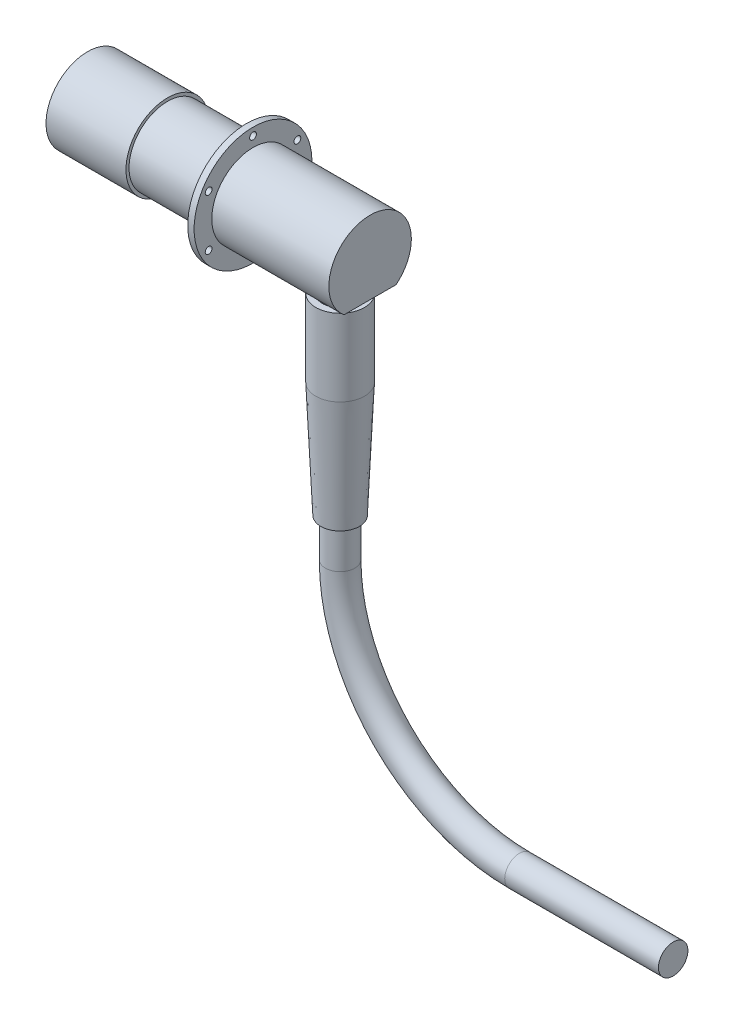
ISO-10303-21;
HEADER;
FILE_DESCRIPTION(('STEP AP214'),'2;1');
FILE_NAME('part.step','',(''),(''),'','','');
FILE_SCHEMA(('AUTOMOTIVE_DESIGN { 1 0 10303 214 1 1 1 1 }'));
ENDSEC;
DATA;
#1=APPLICATION_CONTEXT('core data for automotive mechanical design processes');
#2=APPLICATION_PROTOCOL_DEFINITION('international standard','automotive_design',2000,#1);
#3=PRODUCT_CONTEXT('',#1,'mechanical');
#4=PRODUCT('Part','Part','',(#3));
#5=PRODUCT_RELATED_PRODUCT_CATEGORY('part','',(#4));
#6=PRODUCT_DEFINITION_FORMATION('','',#4);
#7=PRODUCT_DEFINITION_CONTEXT('part definition',#1,'design');
#8=PRODUCT_DEFINITION('design','',#6,#7);
#9=PRODUCT_DEFINITION_SHAPE('','',#8);
#10=(LENGTH_UNIT() NAMED_UNIT(*) SI_UNIT(.MILLI.,.METRE.));
#11=(NAMED_UNIT(*) PLANE_ANGLE_UNIT() SI_UNIT($,.RADIAN.));
#12=(NAMED_UNIT(*) SI_UNIT($,.STERADIAN.) SOLID_ANGLE_UNIT());
#13=UNCERTAINTY_MEASURE_WITH_UNIT(LENGTH_MEASURE(1.E-05),#10,'distance_accuracy_value','');
#14=(GEOMETRIC_REPRESENTATION_CONTEXT(3) GLOBAL_UNCERTAINTY_ASSIGNED_CONTEXT((#13)) GLOBAL_UNIT_ASSIGNED_CONTEXT((#10,
#11,#12)) REPRESENTATION_CONTEXT('',''));
#15=CARTESIAN_POINT('',(0.,0.,0.));
#16=DIRECTION('',(0.,0.,1.));
#17=DIRECTION('',(1.,0.,0.));
#18=AXIS2_PLACEMENT_3D('',#15,#16,#17);
#19=CARTESIAN_POINT('',(0.,0.,0.));
#20=DIRECTION('',(1.,0.,0.));
#21=DIRECTION('',(0.,0.,-1.));
#22=AXIS2_PLACEMENT_3D('',#19,#20,#21);
#23=PLANE('',#22);
#24=CARTESIAN_POINT('',(0.,0.,0.));
#25=DIRECTION('',(-1.,0.,0.));
#26=DIRECTION('',(0.,0.,1.));
#27=AXIS2_PLACEMENT_3D('',#24,#25,#26);
#28=CIRCLE('',#27,32.7904477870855);
#29=CARTESIAN_POINT('',(0.,0.,32.7904477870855));
#30=VERTEX_POINT('',#29);
#31=EDGE_CURVE('E421',#30,#30,#28,.T.);
#32=ORIENTED_EDGE('',*,*,#31,.F.);
#33=EDGE_LOOP('',(#32));
#34=FACE_BOUND('',#33,.T.);
#35=CARTESIAN_POINT('',(0.,0.,0.));
#36=DIRECTION('',(1.,0.,0.));
#37=DIRECTION('',(0.,0.,-1.));
#38=AXIS2_PLACEMENT_3D('',#35,#36,#37);
#39=CIRCLE('',#38,41.148);
#40=CARTESIAN_POINT('',(0.,0.,-41.148));
#41=VERTEX_POINT('',#40);
#42=EDGE_CURVE('E449',#41,#41,#39,.T.);
#43=ORIENTED_EDGE('',*,*,#42,.F.);
#44=EDGE_LOOP('',(#43));
#45=FACE_BOUND('',#44,.T.);
#46=ADVANCED_FACE('F380',(#34,#45),#23,.F.);
#47=CARTESIAN_POINT('',(0.,0.,0.));
#48=DIRECTION('',(1.,0.,0.));
#49=DIRECTION('',(0.,0.,-1.));
#50=AXIS2_PLACEMENT_3D('',#47,#48,#49);
#51=CYLINDRICAL_SURFACE('',#50,41.148);
#52=CARTESIAN_POINT('',(79.248,0.,1.11022302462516E-13));
#53=DIRECTION('',(1.,0.,0.));
#54=DIRECTION('',(0.,0.,-1.));
#55=AXIS2_PLACEMENT_3D('',#52,#53,#54);
#56=CIRCLE('',#55,41.148);
#57=CARTESIAN_POINT('',(79.248,0.,-41.1479999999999));
#58=VERTEX_POINT('',#57);
#59=EDGE_CURVE('E446',#58,#58,#56,.T.);
#60=ORIENTED_EDGE('',*,*,#59,.F.);
#61=EDGE_LOOP('',(#60));
#62=FACE_BOUND('',#61,.T.);
#63=ORIENTED_EDGE('',*,*,#42,.T.);
#64=EDGE_LOOP('',(#63));
#65=FACE_BOUND('',#64,.T.);
#66=ADVANCED_FACE('F466',(#62,#65),#51,.T.);
#67=CARTESIAN_POINT('',(79.248,-41.148,1.11022302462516E-13));
#68=DIRECTION('',(-1.,0.,0.));
#69=DIRECTION('',(0.,0.,1.));
#70=AXIS2_PLACEMENT_3D('',#67,#68,#69);
#71=PLANE('',#70);
#72=CARTESIAN_POINT('',(79.248,0.,1.11022302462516E-13));
#73=DIRECTION('',(1.,0.,0.));
#74=DIRECTION('',(0.,0.,-1.));
#75=AXIS2_PLACEMENT_3D('',#72,#73,#74);
#76=CIRCLE('',#75,38.1);
#77=CARTESIAN_POINT('',(79.248,0.,-38.0999999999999));
#78=VERTEX_POINT('',#77);
#79=EDGE_CURVE('E443',#78,#78,#76,.T.);
#80=ORIENTED_EDGE('',*,*,#79,.F.);
#81=EDGE_LOOP('',(#80));
#82=FACE_BOUND('',#81,.T.);
#83=ORIENTED_EDGE('',*,*,#59,.T.);
#84=EDGE_LOOP('',(#83));
#85=FACE_BOUND('',#84,.T.);
#86=ADVANCED_FACE('F471',(#82,#85),#71,.F.);
#87=CARTESIAN_POINT('',(0.,0.,0.));
#88=DIRECTION('',(1.,0.,0.));
#89=DIRECTION('',(0.,0.,-1.));
#90=AXIS2_PLACEMENT_3D('',#87,#88,#89);
#91=CYLINDRICAL_SURFACE('',#90,38.1);
#92=CARTESIAN_POINT('',(157.734,2.22044604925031E-13,0.));
#93=DIRECTION('',(1.,0.,0.));
#94=DIRECTION('',(0.,0.,-1.));
#95=AXIS2_PLACEMENT_3D('',#92,#93,#94);
#96=CIRCLE('',#95,38.1);
#97=CARTESIAN_POINT('',(157.734,2.22044604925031E-13,-38.1));
#98=VERTEX_POINT('',#97);
#99=EDGE_CURVE('E440',#98,#98,#96,.T.);
#100=ORIENTED_EDGE('',*,*,#99,.F.);
#101=EDGE_LOOP('',(#100));
#102=FACE_BOUND('',#101,.T.);
#103=ORIENTED_EDGE('',*,*,#79,.T.);
#104=EDGE_LOOP('',(#103));
#105=FACE_BOUND('',#104,.T.);
#106=ADVANCED_FACE('F481',(#102,#105),#91,.T.);
#107=CARTESIAN_POINT('',(157.734,-38.1,0.));
#108=DIRECTION('',(1.,0.,0.));
#109=DIRECTION('',(0.,0.,-1.));
#110=AXIS2_PLACEMENT_3D('',#107,#108,#109);
#111=PLANE('',#110);
#112=CARTESIAN_POINT('',(157.734,25.4000000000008,43.9940905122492));
#113=DIRECTION('',(-1.,0.,0.));
#114=DIRECTION('',(0.,-0.866025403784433,0.50000000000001));
#115=AXIS2_PLACEMENT_3D('',#112,#113,#114);
#116=CIRCLE('',#115,3.3782);
#117=CARTESIAN_POINT('',(157.734,22.4743929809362,45.6831905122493));
#118=VERTEX_POINT('',#117);
#119=EDGE_CURVE('E728',#118,#118,#116,.T.);
#120=ORIENTED_EDGE('',*,*,#119,.F.);
#121=EDGE_LOOP('',(#120));
#122=FACE_BOUND('',#121,.T.);
#123=CARTESIAN_POINT('',(157.734,-25.3999999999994,43.9940905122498));
#124=DIRECTION('',(-1.,0.,0.));
#125=DIRECTION('',(0.,-0.866025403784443,-0.499999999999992));
#126=AXIS2_PLACEMENT_3D('',#123,#124,#125);
#127=CIRCLE('',#126,3.3782);
#128=CARTESIAN_POINT('',(157.734,-28.325607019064,42.3049905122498));
#129=VERTEX_POINT('',#128);
#130=EDGE_CURVE('E739',#129,#129,#127,.T.);
#131=ORIENTED_EDGE('',*,*,#130,.F.);
#132=EDGE_LOOP('',(#131));
#133=FACE_BOUND('',#132,.T.);
#134=CARTESIAN_POINT('',(157.734,-50.8,3.60822483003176E-13));
#135=DIRECTION('',(-1.,0.,0.));
#136=DIRECTION('',(0.,0.,-1.));
#137=AXIS2_PLACEMENT_3D('',#134,#135,#136);
#138=CIRCLE('',#137,3.3782);
#139=CARTESIAN_POINT('',(157.734,-50.8,-3.37819999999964));
#140=VERTEX_POINT('',#139);
#141=EDGE_CURVE('E743',#140,#140,#138,.T.);
#142=ORIENTED_EDGE('',*,*,#141,.F.);
#143=EDGE_LOOP('',(#142));
#144=FACE_BOUND('',#143,.T.);
#145=CARTESIAN_POINT('',(157.734,-25.4,-43.9940905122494));
#146=DIRECTION('',(-1.,0.,0.));
#147=DIRECTION('',(0.,0.866025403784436,-0.500000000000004));
#148=AXIS2_PLACEMENT_3D('',#145,#146,#147);
#149=CIRCLE('',#148,3.3782);
#150=CARTESIAN_POINT('',(157.734,-22.4743929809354,-45.6831905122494));
#151=VERTEX_POINT('',#150);
#152=EDGE_CURVE('E745',#151,#151,#149,.T.);
#153=ORIENTED_EDGE('',*,*,#152,.F.);
#154=EDGE_LOOP('',(#153));
#155=FACE_BOUND('',#154,.T.);
#156=CARTESIAN_POINT('',(157.734,25.4000000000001,-43.9940905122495));
#157=DIRECTION('',(-1.,0.,0.));
#158=DIRECTION('',(0.,0.86602540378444,0.499999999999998));
#159=AXIS2_PLACEMENT_3D('',#156,#157,#158);
#160=CIRCLE('',#159,3.3782);
#161=CARTESIAN_POINT('',(157.734,28.3256070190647,-42.3049905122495));
#162=VERTEX_POINT('',#161);
#163=EDGE_CURVE('E751',#162,#162,#160,.T.);
#164=ORIENTED_EDGE('',*,*,#163,.F.);
#165=EDGE_LOOP('',(#164));
#166=FACE_BOUND('',#165,.T.);
#167=CARTESIAN_POINT('',(157.734,50.8000000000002,0.));
#168=DIRECTION('',(-1.,0.,0.));
#169=DIRECTION('',(0.,0.,1.));
#170=AXIS2_PLACEMENT_3D('',#167,#168,#169);
#171=CIRCLE('',#170,3.3782);
#172=CARTESIAN_POINT('',(157.734,50.8000000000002,3.3782));
#173=VERTEX_POINT('',#172);
#174=EDGE_CURVE('E538',#173,#173,#171,.T.);
#175=ORIENTED_EDGE('',*,*,#174,.F.);
#176=EDGE_LOOP('',(#175));
#177=FACE_BOUND('',#176,.T.);
#178=CARTESIAN_POINT('',(157.734,2.22044604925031E-13,0.));
#179=DIRECTION('',(1.,0.,0.));
#180=DIRECTION('',(0.,0.,-1.));
#181=AXIS2_PLACEMENT_3D('',#178,#179,#180);
#182=CIRCLE('',#181,58.42);
#183=CARTESIAN_POINT('',(157.734,2.22044604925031E-13,-58.42));
#184=VERTEX_POINT('',#183);
#185=EDGE_CURVE('E437',#184,#184,#182,.T.);
#186=ORIENTED_EDGE('',*,*,#185,.F.);
#187=EDGE_LOOP('',(#186));
#188=FACE_BOUND('',#187,.T.);
#189=ORIENTED_EDGE('',*,*,#99,.T.);
#190=EDGE_LOOP('',(#189));
#191=FACE_BOUND('',#190,.T.);
#192=ADVANCED_FACE('F488',(#122,#133,#144,#155,#166,#177,#188,#191),#111,.F.);
#193=CARTESIAN_POINT('',(0.,0.,0.));
#194=DIRECTION('',(1.,0.,0.));
#195=DIRECTION('',(0.,0.,-1.));
#196=AXIS2_PLACEMENT_3D('',#193,#194,#195);
#197=CYLINDRICAL_SURFACE('',#196,58.42);
#198=CARTESIAN_POINT('',(164.084,2.22044604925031E-13,0.));
#199=DIRECTION('',(1.,0.,0.));
#200=DIRECTION('',(0.,0.,-1.));
#201=AXIS2_PLACEMENT_3D('',#198,#199,#200);
#202=CIRCLE('',#201,58.42);
#203=CARTESIAN_POINT('',(164.084,2.22044604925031E-13,-58.42));
#204=VERTEX_POINT('',#203);
#205=EDGE_CURVE('E434',#204,#204,#202,.T.);
#206=ORIENTED_EDGE('',*,*,#205,.F.);
#207=EDGE_LOOP('',(#206));
#208=FACE_BOUND('',#207,.T.);
#209=ORIENTED_EDGE('',*,*,#185,.T.);
#210=EDGE_LOOP('',(#209));
#211=FACE_BOUND('',#210,.T.);
#212=ADVANCED_FACE('F492',(#208,#211),#197,.T.);
#213=CARTESIAN_POINT('',(164.084,-58.42,0.));
#214=DIRECTION('',(-1.,0.,0.));
#215=DIRECTION('',(0.,0.,1.));
#216=AXIS2_PLACEMENT_3D('',#213,#214,#215);
#217=PLANE('',#216);
#218=CARTESIAN_POINT('',(164.084,25.4000000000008,43.9940905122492));
#219=DIRECTION('',(-1.,0.,0.));
#220=DIRECTION('',(0.,0.,1.));
#221=AXIS2_PLACEMENT_3D('',#218,#219,#220);
#222=CIRCLE('',#221,3.3782);
#223=CARTESIAN_POINT('',(164.084,25.4000000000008,47.3722905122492));
#224=VERTEX_POINT('',#223);
#225=EDGE_CURVE('E504',#224,#224,#222,.F.);
#226=ORIENTED_EDGE('',*,*,#225,.F.);
#227=EDGE_LOOP('',(#226));
#228=FACE_BOUND('',#227,.T.);
#229=CARTESIAN_POINT('',(164.084,-25.3999999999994,43.9940905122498));
#230=DIRECTION('',(-1.,0.,0.));
#231=DIRECTION('',(0.,0.,1.));
#232=AXIS2_PLACEMENT_3D('',#229,#230,#231);
#233=CIRCLE('',#232,3.3782);
#234=CARTESIAN_POINT('',(164.084,-25.3999999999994,47.3722905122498));
#235=VERTEX_POINT('',#234);
#236=EDGE_CURVE('E508',#235,#235,#233,.F.);
#237=ORIENTED_EDGE('',*,*,#236,.F.);
#238=EDGE_LOOP('',(#237));
#239=FACE_BOUND('',#238,.T.);
#240=CARTESIAN_POINT('',(164.084,-50.8,3.60822483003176E-13));
#241=DIRECTION('',(-1.,0.,0.));
#242=DIRECTION('',(0.,0.,1.));
#243=AXIS2_PLACEMENT_3D('',#240,#241,#242);
#244=CIRCLE('',#243,3.3782);
#245=CARTESIAN_POINT('',(164.084,-50.8,3.37820000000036));
#246=VERTEX_POINT('',#245);
#247=EDGE_CURVE('E512',#246,#246,#244,.F.);
#248=ORIENTED_EDGE('',*,*,#247,.F.);
#249=EDGE_LOOP('',(#248));
#250=FACE_BOUND('',#249,.T.);
#251=CARTESIAN_POINT('',(164.084,-25.4,-43.9940905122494));
#252=DIRECTION('',(-1.,0.,0.));
#253=DIRECTION('',(0.,0.,1.));
#254=AXIS2_PLACEMENT_3D('',#251,#252,#253);
#255=CIRCLE('',#254,3.3782);
#256=CARTESIAN_POINT('',(164.084,-25.4,-40.6158905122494));
#257=VERTEX_POINT('',#256);
#258=EDGE_CURVE('E516',#257,#257,#255,.F.);
#259=ORIENTED_EDGE('',*,*,#258,.F.);
#260=EDGE_LOOP('',(#259));
#261=FACE_BOUND('',#260,.T.);
#262=CARTESIAN_POINT('',(164.084,25.4000000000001,-43.9940905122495));
#263=DIRECTION('',(-1.,0.,0.));
#264=DIRECTION('',(0.,0.,1.));
#265=AXIS2_PLACEMENT_3D('',#262,#263,#264);
#266=CIRCLE('',#265,3.3782);
#267=CARTESIAN_POINT('',(164.084,25.4000000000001,-40.6158905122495));
#268=VERTEX_POINT('',#267);
#269=EDGE_CURVE('E520',#268,#268,#266,.F.);
#270=ORIENTED_EDGE('',*,*,#269,.F.);
#271=EDGE_LOOP('',(#270));
#272=FACE_BOUND('',#271,.T.);
#273=CARTESIAN_POINT('',(164.084,50.8000000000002,0.));
#274=DIRECTION('',(-1.,0.,0.));
#275=DIRECTION('',(0.,0.,1.));
#276=AXIS2_PLACEMENT_3D('',#273,#274,#275);
#277=CIRCLE('',#276,3.3782);
#278=CARTESIAN_POINT('',(164.084,50.8000000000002,3.3782));
#279=VERTEX_POINT('',#278);
#280=EDGE_CURVE('E524',#279,#279,#277,.F.);
#281=ORIENTED_EDGE('',*,*,#280,.F.);
#282=EDGE_LOOP('',(#281));
#283=FACE_BOUND('',#282,.T.);
#284=CARTESIAN_POINT('',(164.084,2.22044604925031E-13,0.));
#285=DIRECTION('',(1.,0.,0.));
#286=DIRECTION('',(0.,0.,-1.));
#287=AXIS2_PLACEMENT_3D('',#284,#285,#286);
#288=CIRCLE('',#287,40.894);
#289=CARTESIAN_POINT('',(164.084,2.22044604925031E-13,-40.894));
#290=VERTEX_POINT('',#289);
#291=EDGE_CURVE('E431',#290,#290,#288,.T.);
#292=ORIENTED_EDGE('',*,*,#291,.F.);
#293=EDGE_LOOP('',(#292));
#294=FACE_BOUND('',#293,.T.);
#295=ORIENTED_EDGE('',*,*,#205,.T.);
#296=EDGE_LOOP('',(#295));
#297=FACE_BOUND('',#296,.T.);
#298=ADVANCED_FACE('F463',(#228,#239,#250,#261,#272,#283,#294,#297),#217,.F.);
#299=CARTESIAN_POINT('',(0.,0.,0.));
#300=DIRECTION('',(1.,0.,0.));
#301=DIRECTION('',(0.,0.,-1.));
#302=AXIS2_PLACEMENT_3D('',#299,#300,#301);
#303=CYLINDRICAL_SURFACE('',#302,40.894);
#304=CARTESIAN_POINT('',(264.587074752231,0.,0.));
#305=DIRECTION('',(-0.707106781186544,0.707106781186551,0.));
#306=DIRECTION('',(0.707106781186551,0.707106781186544,0.));
#307=AXIS2_PLACEMENT_3D('',#304,#305,#306);
#308=ELLIPSE('',#307,57.8328494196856,40.894);
#309=CARTESIAN_POINT('',(232.83707475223,-31.7499999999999,-25.7731786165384));
#310=VERTEX_POINT('',#309);
#311=CARTESIAN_POINT('',(232.83707475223,-31.7499999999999,25.7731786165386));
#312=VERTEX_POINT('',#311);
#313=EDGE_CURVE('E383',#310,#312,#308,.T.);
#314=ORIENTED_EDGE('',*,*,#313,.T.);
#315=DIRECTION('',(1.,0.,0.));
#316=VECTOR('',#315,1.);
#317=CARTESIAN_POINT('',(0.,-31.7499999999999,25.7731786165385));
#318=LINE('',#317,#316);
#319=CARTESIAN_POINT('',(280.162,-31.7499999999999,25.7731786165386));
#320=VERTEX_POINT('',#319);
#321=EDGE_CURVE('E412',#312,#320,#318,.T.);
#322=ORIENTED_EDGE('',*,*,#321,.T.);
#323=CARTESIAN_POINT('',(280.162,0.,0.));
#324=DIRECTION('',(1.,0.,0.));
#325=DIRECTION('',(0.,0.,-1.));
#326=AXIS2_PLACEMENT_3D('',#323,#324,#325);
#327=CIRCLE('',#326,40.894);
#328=CARTESIAN_POINT('',(280.162,-31.7499999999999,-25.7731786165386));
#329=VERTEX_POINT('',#328);
#330=EDGE_CURVE('E419',#329,#320,#327,.T.);
#331=ORIENTED_EDGE('',*,*,#330,.F.);
#332=DIRECTION('',(1.,0.,0.));
#333=VECTOR('',#332,1.);
#334=CARTESIAN_POINT('',(0.,-31.7499999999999,-25.7731786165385));
#335=LINE('',#334,#333);
#336=EDGE_CURVE('E395',#329,#310,#335,.F.);
#337=ORIENTED_EDGE('',*,*,#336,.T.);
#338=EDGE_LOOP('',(#314,#322,#331,#337));
#339=FACE_BOUND('',#338,.T.);
#340=ORIENTED_EDGE('',*,*,#291,.T.);
#341=EDGE_LOOP('',(#340));
#342=FACE_BOUND('',#341,.T.);
#343=ADVANCED_FACE('F416',(#339,#342),#303,.T.);
#344=CARTESIAN_POINT('',(280.162,-40.894,0.));
#345=DIRECTION('',(-1.,0.,0.));
#346=DIRECTION('',(0.,0.,1.));
#347=AXIS2_PLACEMENT_3D('',#344,#345,#346);
#348=PLANE('',#347);
#349=ORIENTED_EDGE('',*,*,#330,.T.);
#350=DIRECTION('',(0.,0.,-1.));
#351=VECTOR('',#350,1.);
#352=CARTESIAN_POINT('',(280.162,-31.7499999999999,0.));
#353=LINE('',#352,#351);
#354=EDGE_CURVE('E399',#320,#329,#353,.T.);
#355=ORIENTED_EDGE('',*,*,#354,.T.);
#356=EDGE_LOOP('',(#349,#355));
#357=FACE_BOUND('',#356,.T.);
#358=ADVANCED_FACE('F452',(#357),#348,.F.);
#359=CARTESIAN_POINT('',(69.85,0.,1.11022302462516E-13));
#360=DIRECTION('',(-1.,0.,0.));
#361=DIRECTION('',(0.,0.,1.));
#362=AXIS2_PLACEMENT_3D('',#359,#360,#361);
#363=CYLINDRICAL_SURFACE('',#362,32.7904477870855);
#364=CARTESIAN_POINT('',(69.85,0.,1.11022302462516E-13));
#365=DIRECTION('',(-1.,0.,0.));
#366=DIRECTION('',(0.,0.,1.));
#367=AXIS2_PLACEMENT_3D('',#364,#365,#366);
#368=CIRCLE('',#367,32.7904477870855);
#369=CARTESIAN_POINT('',(69.85,0.,32.7904477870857));
#370=VERTEX_POINT('',#369);
#371=EDGE_CURVE('E427',#370,#370,#368,.T.);
#372=ORIENTED_EDGE('',*,*,#371,.F.);
#373=EDGE_LOOP('',(#372));
#374=FACE_BOUND('',#373,.T.);
#375=ORIENTED_EDGE('',*,*,#31,.T.);
#376=EDGE_LOOP('',(#375));
#377=FACE_BOUND('',#376,.T.);
#378=ADVANCED_FACE('F454',(#374,#377),#363,.F.);
#379=CARTESIAN_POINT('',(69.85,0.,1.11022302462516E-13));
#380=DIRECTION('',(-1.,0.,0.));
#381=DIRECTION('',(0.,0.,1.));
#382=AXIS2_PLACEMENT_3D('',#379,#380,#381);
#383=PLANE('',#382);
#384=ORIENTED_EDGE('',*,*,#371,.T.);
#385=EDGE_LOOP('',(#384));
#386=FACE_BOUND('',#385,.T.);
#387=ADVANCED_FACE('F460',(#386),#383,.T.);
#388=CARTESIAN_POINT('',(232.83707475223,-31.7499999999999,-38.0999999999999));
#389=DIRECTION('',(-0.707106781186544,0.707106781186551,0.));
#390=DIRECTION('',(-0.707106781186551,-0.707106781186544,0.));
#391=AXIS2_PLACEMENT_3D('',#388,#389,#390);
#392=PLANE('',#391);
#393=DIRECTION('',(0.,0.,1.));
#394=VECTOR('',#393,1.);
#395=CARTESIAN_POINT('',(232.83707475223,-31.7499999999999,-38.0999999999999));
#396=LINE('',#395,#394);
#397=EDGE_CURVE('E409',#310,#312,#396,.T.);
#398=ORIENTED_EDGE('',*,*,#397,.T.);
#399=ORIENTED_EDGE('',*,*,#313,.F.);
#400=EDGE_LOOP('',(#398,#399));
#401=FACE_BOUND('',#400,.T.);
#402=ADVANCED_FACE('F408',(#401),#392,.F.);
#403=CARTESIAN_POINT('',(288.741448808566,-31.7499999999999,-38.1));
#404=DIRECTION('',(0.,1.,0.));
#405=DIRECTION('',(-1.,0.,0.));
#406=AXIS2_PLACEMENT_3D('',#403,#404,#405);
#407=PLANE('',#406);
#408=CARTESIAN_POINT('',(250.444,-31.7499999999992,1.11022302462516E-13));
#409=DIRECTION('',(0.,-1.,0.));
#410=DIRECTION('',(0.,0.,-1.));
#411=AXIS2_PLACEMENT_3D('',#408,#409,#410);
#412=CIRCLE('',#411,16.5100000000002);
#413=CARTESIAN_POINT('',(250.444,-31.7499999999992,-16.5100000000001));
#414=VERTEX_POINT('',#413);
#415=EDGE_CURVE('E537',#414,#414,#412,.T.);
#416=ORIENTED_EDGE('',*,*,#415,.F.);
#417=EDGE_LOOP('',(#416));
#418=FACE_BOUND('',#417,.T.);
#419=ORIENTED_EDGE('',*,*,#397,.F.);
#420=ORIENTED_EDGE('',*,*,#336,.F.);
#421=ORIENTED_EDGE('',*,*,#354,.F.);
#422=ORIENTED_EDGE('',*,*,#321,.F.);
#423=EDGE_LOOP('',(#419,#420,#421,#422));
#424=FACE_BOUND('',#423,.T.);
#425=ADVANCED_FACE('F411',(#418,#424),#407,.F.);
#426=CARTESIAN_POINT('',(250.444,-231.720645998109,1.11022302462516E-13));
#427=DIRECTION('',(0.,-1.,0.));
#428=DIRECTION('',(0.,0.,-1.));
#429=AXIS2_PLACEMENT_3D('',#426,#427,#428);
#430=PLANE('',#429);
#431=CARTESIAN_POINT('',(250.444,-231.720645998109,1.11022302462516E-13));
#432=DIRECTION('',(0.,-1.,0.));
#433=DIRECTION('',(0.,0.,-1.));
#434=AXIS2_PLACEMENT_3D('',#431,#432,#433);
#435=CIRCLE('',#434,14.605);
#436=CARTESIAN_POINT('',(250.444,-231.720645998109,-14.6049999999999));
#437=VERTEX_POINT('',#436);
#438=EDGE_CURVE('E11',#437,#437,#435,.T.);
#439=ORIENTED_EDGE('',*,*,#438,.F.);
#440=EDGE_LOOP('',(#439));
#441=FACE_BOUND('',#440,.T.);
#442=CARTESIAN_POINT('',(250.444,-231.720645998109,1.11022302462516E-13));
#443=DIRECTION('',(0.,-1.,0.));
#444=DIRECTION('',(0.,0.,-1.));
#445=AXIS2_PLACEMENT_3D('',#442,#443,#444);
#446=CIRCLE('',#445,19.1395542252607);
#447=CARTESIAN_POINT('',(250.444,-231.720645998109,-19.1395542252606));
#448=VERTEX_POINT('',#447);
#449=EDGE_CURVE('E413',#448,#448,#446,.T.);
#450=ORIENTED_EDGE('',*,*,#449,.T.);
#451=EDGE_LOOP('',(#450));
#452=FACE_BOUND('',#451,.T.);
#453=ADVANCED_FACE('F563',(#441,#452),#430,.T.);
#454=CARTESIAN_POINT('',(250.444,-231.720645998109,1.11022302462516E-13));
#455=DIRECTION('',(0.,1.,0.));
#456=DIRECTION('',(0.,0.,1.));
#457=AXIS2_PLACEMENT_3D('',#454,#455,#456);
#458=CONICAL_SURFACE('',#457,19.1395542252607,0.0436332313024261);
#459=CARTESIAN_POINT('',(250.444,-117.420645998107,1.11022302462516E-13));
#460=DIRECTION('',(0.,-1.,0.));
#461=DIRECTION('',(0.,0.,-1.));
#462=AXIS2_PLACEMENT_3D('',#459,#460,#461);
#463=CIRCLE('',#462,24.1299999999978);
#464=CARTESIAN_POINT('',(250.444,-117.420645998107,-24.1299999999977));
#465=VERTEX_POINT('',#464);
#466=EDGE_CURVE('E558',#465,#465,#463,.T.);
#467=ORIENTED_EDGE('',*,*,#466,.T.);
#468=EDGE_LOOP('',(#467));
#469=FACE_BOUND('',#468,.T.);
#470=ORIENTED_EDGE('',*,*,#449,.F.);
#471=EDGE_LOOP('',(#470));
#472=FACE_BOUND('',#471,.T.);
#473=ADVANCED_FACE('F565',(#469,#472),#458,.T.);
#474=CARTESIAN_POINT('',(250.444,-263.776831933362,1.11022302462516E-13));
#475=DIRECTION('',(0.,-1.,0.));
#476=DIRECTION('',(0.,0.,-1.));
#477=AXIS2_PLACEMENT_3D('',#474,#475,#476);
#478=CYLINDRICAL_SURFACE('',#477,24.1299999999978);
#479=CARTESIAN_POINT('',(250.444,-41.2206459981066,1.11022302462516E-13));
#480=DIRECTION('',(0.,-1.,0.));
#481=DIRECTION('',(0.,0.,-1.));
#482=AXIS2_PLACEMENT_3D('',#479,#480,#481);
#483=CIRCLE('',#482,24.1299999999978);
#484=CARTESIAN_POINT('',(250.444,-41.2206459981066,-24.1299999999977));
#485=VERTEX_POINT('',#484);
#486=EDGE_CURVE('E555',#485,#485,#483,.T.);
#487=ORIENTED_EDGE('',*,*,#486,.T.);
#488=EDGE_LOOP('',(#487));
#489=FACE_BOUND('',#488,.T.);
#490=ORIENTED_EDGE('',*,*,#466,.F.);
#491=EDGE_LOOP('',(#490));
#492=FACE_BOUND('',#491,.T.);
#493=ADVANCED_FACE('F567',(#489,#492),#478,.T.);
#494=CARTESIAN_POINT('',(267.906500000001,-41.2206459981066,1.11022302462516E-13));
#495=DIRECTION('',(0.,1.,0.));
#496=DIRECTION('',(0.,0.,1.));
#497=AXIS2_PLACEMENT_3D('',#494,#495,#496);
#498=PLANE('',#497);
#499=CARTESIAN_POINT('',(250.444,-41.2206459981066,1.11022302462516E-13));
#500=DIRECTION('',(0.,-1.,0.));
#501=DIRECTION('',(0.,0.,-1.));
#502=AXIS2_PLACEMENT_3D('',#499,#500,#501);
#503=CIRCLE('',#502,17.4625000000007);
#504=CARTESIAN_POINT('',(250.444,-41.2206459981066,-17.4625000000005));
#505=VERTEX_POINT('',#504);
#506=EDGE_CURVE('E552',#505,#505,#503,.T.);
#507=ORIENTED_EDGE('',*,*,#506,.T.);
#508=EDGE_LOOP('',(#507));
#509=FACE_BOUND('',#508,.T.);
#510=ORIENTED_EDGE('',*,*,#486,.F.);
#511=EDGE_LOOP('',(#510));
#512=FACE_BOUND('',#511,.T.);
#513=ADVANCED_FACE('F575',(#509,#512),#498,.T.);
#514=CARTESIAN_POINT('',(250.444,-263.776831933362,1.11022302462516E-13));
#515=DIRECTION('',(0.,-1.,0.));
#516=DIRECTION('',(0.,0.,-1.));
#517=AXIS2_PLACEMENT_3D('',#514,#515,#516);
#518=CYLINDRICAL_SURFACE('',#517,17.4625000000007);
#519=CARTESIAN_POINT('',(250.444,-38.0456459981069,1.11022302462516E-13));
#520=DIRECTION('',(0.,-1.,0.));
#521=DIRECTION('',(0.,0.,-1.));
#522=AXIS2_PLACEMENT_3D('',#519,#520,#521);
#523=CIRCLE('',#522,17.4625000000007);
#524=CARTESIAN_POINT('',(250.444,-38.0456459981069,-17.4625000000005));
#525=VERTEX_POINT('',#524);
#526=EDGE_CURVE('E549',#525,#525,#523,.T.);
#527=ORIENTED_EDGE('',*,*,#526,.T.);
#528=EDGE_LOOP('',(#527));
#529=FACE_BOUND('',#528,.T.);
#530=ORIENTED_EDGE('',*,*,#506,.F.);
#531=EDGE_LOOP('',(#530));
#532=FACE_BOUND('',#531,.T.);
#533=ADVANCED_FACE('F619',(#529,#532),#518,.T.);
#534=CARTESIAN_POINT('',(266.954,-38.0456459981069,1.11022302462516E-13));
#535=DIRECTION('',(0.,1.,0.));
#536=DIRECTION('',(0.,0.,1.));
#537=AXIS2_PLACEMENT_3D('',#534,#535,#536);
#538=PLANE('',#537);
#539=CARTESIAN_POINT('',(250.444,-38.0456459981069,1.11022302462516E-13));
#540=DIRECTION('',(0.,-1.,0.));
#541=DIRECTION('',(0.,0.,-1.));
#542=AXIS2_PLACEMENT_3D('',#539,#540,#541);
#543=CIRCLE('',#542,16.5100000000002);
#544=CARTESIAN_POINT('',(250.444,-38.0456459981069,-16.5100000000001));
#545=VERTEX_POINT('',#544);
#546=EDGE_CURVE('E541',#545,#545,#543,.T.);
#547=ORIENTED_EDGE('',*,*,#546,.T.);
#548=EDGE_LOOP('',(#547));
#549=FACE_BOUND('',#548,.T.);
#550=ORIENTED_EDGE('',*,*,#526,.F.);
#551=EDGE_LOOP('',(#550));
#552=FACE_BOUND('',#551,.T.);
#553=ADVANCED_FACE('F626',(#549,#552),#538,.T.);
#554=CARTESIAN_POINT('',(250.444,-263.776831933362,1.11022302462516E-13));
#555=DIRECTION('',(0.,-1.,0.));
#556=DIRECTION('',(0.,0.,-1.));
#557=AXIS2_PLACEMENT_3D('',#554,#555,#556);
#558=CYLINDRICAL_SURFACE('',#557,16.5100000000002);
#559=ORIENTED_EDGE('',*,*,#415,.T.);
#560=EDGE_LOOP('',(#559));
#561=FACE_BOUND('',#560,.T.);
#562=ORIENTED_EDGE('',*,*,#546,.F.);
#563=EDGE_LOOP('',(#562));
#564=FACE_BOUND('',#563,.T.);
#565=ADVANCED_FACE('F634',(#561,#564),#558,.T.);
#566=CARTESIAN_POINT('',(280.163,50.8,0.));
#567=DIRECTION('',(-1.,0.,0.));
#568=DIRECTION('',(0.,0.,1.));
#569=AXIS2_PLACEMENT_3D('',#566,#567,#568);
#570=CYLINDRICAL_SURFACE('',#569,3.3782);
#571=ORIENTED_EDGE('',*,*,#174,.T.);
#572=EDGE_LOOP('',(#571));
#573=FACE_BOUND('',#572,.T.);
#574=ORIENTED_EDGE('',*,*,#280,.T.);
#575=EDGE_LOOP('',(#574));
#576=FACE_BOUND('',#575,.T.);
#577=ADVANCED_FACE('F642',(#573,#576),#570,.F.);
#578=CARTESIAN_POINT('',(280.163,25.3999999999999,-43.9940905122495));
#579=DIRECTION('',(-1.,0.,0.));
#580=DIRECTION('',(0.,0.,1.));
#581=AXIS2_PLACEMENT_3D('',#578,#579,#580);
#582=CYLINDRICAL_SURFACE('',#581,3.3782);
#583=ORIENTED_EDGE('',*,*,#163,.T.);
#584=EDGE_LOOP('',(#583));
#585=FACE_BOUND('',#584,.T.);
#586=ORIENTED_EDGE('',*,*,#269,.T.);
#587=EDGE_LOOP('',(#586));
#588=FACE_BOUND('',#587,.T.);
#589=ADVANCED_FACE('F650',(#585,#588),#582,.F.);
#590=CARTESIAN_POINT('',(280.163,-25.4000000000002,-43.9940905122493));
#591=DIRECTION('',(-1.,0.,0.));
#592=DIRECTION('',(0.,0.,1.));
#593=AXIS2_PLACEMENT_3D('',#590,#591,#592);
#594=CYLINDRICAL_SURFACE('',#593,3.3782);
#595=ORIENTED_EDGE('',*,*,#152,.T.);
#596=EDGE_LOOP('',(#595));
#597=FACE_BOUND('',#596,.T.);
#598=ORIENTED_EDGE('',*,*,#258,.T.);
#599=EDGE_LOOP('',(#598));
#600=FACE_BOUND('',#599,.T.);
#601=ADVANCED_FACE('F658',(#597,#600),#594,.F.);
#602=CARTESIAN_POINT('',(280.163,-50.8,3.60822483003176E-13));
#603=DIRECTION('',(-1.,0.,0.));
#604=DIRECTION('',(0.,0.,1.));
#605=AXIS2_PLACEMENT_3D('',#602,#603,#604);
#606=CYLINDRICAL_SURFACE('',#605,3.3782);
#607=ORIENTED_EDGE('',*,*,#141,.T.);
#608=EDGE_LOOP('',(#607));
#609=FACE_BOUND('',#608,.T.);
#610=ORIENTED_EDGE('',*,*,#247,.T.);
#611=EDGE_LOOP('',(#610));
#612=FACE_BOUND('',#611,.T.);
#613=ADVANCED_FACE('F666',(#609,#612),#606,.F.);
#614=CARTESIAN_POINT('',(280.163,-25.3999999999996,43.9940905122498));
#615=DIRECTION('',(-1.,0.,0.));
#616=DIRECTION('',(0.,0.,1.));
#617=AXIS2_PLACEMENT_3D('',#614,#615,#616);
#618=CYLINDRICAL_SURFACE('',#617,3.3782);
#619=ORIENTED_EDGE('',*,*,#130,.T.);
#620=EDGE_LOOP('',(#619));
#621=FACE_BOUND('',#620,.T.);
#622=ORIENTED_EDGE('',*,*,#236,.T.);
#623=EDGE_LOOP('',(#622));
#624=FACE_BOUND('',#623,.T.);
#625=ADVANCED_FACE('F674',(#621,#624),#618,.F.);
#626=CARTESIAN_POINT('',(280.163,25.4000000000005,43.9940905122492));
#627=DIRECTION('',(-1.,0.,0.));
#628=DIRECTION('',(0.,0.,1.));
#629=AXIS2_PLACEMENT_3D('',#626,#627,#628);
#630=CYLINDRICAL_SURFACE('',#629,3.3782);
#631=ORIENTED_EDGE('',*,*,#119,.T.);
#632=EDGE_LOOP('',(#631));
#633=FACE_BOUND('',#632,.T.);
#634=ORIENTED_EDGE('',*,*,#225,.T.);
#635=EDGE_LOOP('',(#634));
#636=FACE_BOUND('',#635,.T.);
#637=ADVANCED_FACE('F682',(#633,#636),#630,.F.);
#638=CARTESIAN_POINT('',(428.244,-447.620645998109,0.));
#639=DIRECTION('',(1.,0.,0.));
#640=DIRECTION('',(0.,0.,-1.));
#641=AXIS2_PLACEMENT_3D('',#638,#639,#640);
#642=CYLINDRICAL_SURFACE('',#641,14.605);
#643=CARTESIAN_POINT('',(428.244,-447.620645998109,0.));
#644=DIRECTION('',(1.,0.,0.));
#645=DIRECTION('',(0.,0.,-1.));
#646=AXIS2_PLACEMENT_3D('',#643,#644,#645);
#647=CIRCLE('',#646,14.605);
#648=CARTESIAN_POINT('',(428.244,-462.225645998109,0.));
#649=VERTEX_POINT('',#648);
#650=EDGE_CURVE('E729',#649,#649,#647,.T.);
#651=ORIENTED_EDGE('',*,*,#650,.T.);
#652=EDGE_LOOP('',(#651));
#653=FACE_BOUND('',#652,.T.);
#654=CARTESIAN_POINT('',(580.644,-447.620645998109,0.));
#655=DIRECTION('',(1.,0.,0.));
#656=DIRECTION('',(0.,0.,-1.));
#657=AXIS2_PLACEMENT_3D('',#654,#655,#656);
#658=CIRCLE('',#657,14.605);
#659=CARTESIAN_POINT('',(580.644,-447.620645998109,-14.605));
#660=VERTEX_POINT('',#659);
#661=EDGE_CURVE('E726',#660,#660,#658,.T.);
#662=ORIENTED_EDGE('',*,*,#661,.F.);
#663=EDGE_LOOP('',(#662));
#664=FACE_BOUND('',#663,.T.);
#665=ADVANCED_FACE('F690',(#653,#664),#642,.T.);
#666=CARTESIAN_POINT('',(428.244,-269.820645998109,1.11022302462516E-13));
#667=DIRECTION('',(0.,0.,1.));
#668=DIRECTION('',(1.,0.,0.));
#669=AXIS2_PLACEMENT_3D('',#666,#667,#668);
#670=TOROIDAL_SURFACE('',#669,177.8,14.605);
#671=CARTESIAN_POINT('',(250.444,-269.820645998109,1.11022302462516E-13));
#672=DIRECTION('',(0.,-1.,0.));
#673=DIRECTION('',(0.,0.,-1.));
#674=AXIS2_PLACEMENT_3D('',#671,#672,#673);
#675=CIRCLE('',#674,14.605);
#676=CARTESIAN_POINT('',(235.839,-269.820645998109,1.11022302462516E-13));
#677=VERTEX_POINT('',#676);
#678=EDGE_CURVE('E734',#677,#677,#675,.T.);
#679=CARTESIAN_POINT('',(428.244,-269.820645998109,1.11022302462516E-13));
#680=DIRECTION('',(0.,0.,1.));
#681=DIRECTION('',(1.,0.,0.));
#682=AXIS2_PLACEMENT_3D('',#679,#680,#681);
#683=CIRCLE('',#682,192.405);
#684=EDGE_CURVE('',#677,#649,#683,.T.);
#685=ORIENTED_EDGE('',*,*,#678,.T.);
#686=ORIENTED_EDGE('',*,*,#650,.F.);
#687=ORIENTED_EDGE('',*,*,#684,.T.);
#688=ORIENTED_EDGE('',*,*,#684,.F.);
#689=EDGE_LOOP('',(#685,#687,#686,#688));
#690=FACE_BOUND('',#689,.T.);
#691=ADVANCED_FACE('F698',(#690),#670,.T.);
#692=CARTESIAN_POINT('',(250.444,-269.820645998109,1.11022302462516E-13));
#693=DIRECTION('',(0.,1.,0.));
#694=DIRECTION('',(0.,0.,1.));
#695=AXIS2_PLACEMENT_3D('',#692,#693,#694);
#696=CYLINDRICAL_SURFACE('',#695,14.605);
#697=ORIENTED_EDGE('',*,*,#678,.F.);
#698=EDGE_LOOP('',(#697));
#699=FACE_BOUND('',#698,.T.);
#700=ORIENTED_EDGE('',*,*,#438,.T.);
#701=EDGE_LOOP('',(#700));
#702=FACE_BOUND('',#701,.T.);
#703=ADVANCED_FACE('F706',(#699,#702),#696,.T.);
#704=CARTESIAN_POINT('',(580.644,-447.620645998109,0.));
#705=DIRECTION('',(1.,0.,0.));
#706=DIRECTION('',(0.,0.,-1.));
#707=AXIS2_PLACEMENT_3D('',#704,#705,#706);
#708=PLANE('',#707);
#709=ORIENTED_EDGE('',*,*,#661,.T.);
#710=EDGE_LOOP('',(#709));
#711=FACE_BOUND('',#710,.T.);
#712=ADVANCED_FACE('F714',(#711),#708,.T.);
#713=CLOSED_SHELL('',(#46,#66,#86,#106,#192,#212,#298,#343,#358,#378,#387,#402,#425,#453,#473,
#493,#513,#533,#553,#565,#577,#589,#601,#613,#625,#637,#665,#691,#703,#712));
#714=MANIFOLD_SOLID_BREP('B2',#713);
#715=ADVANCED_BREP_SHAPE_REPRESENTATION('',(#18,#714),#14);
#716=SHAPE_DEFINITION_REPRESENTATION(#9,#715);
ENDSEC;
END-ISO-10303-21;
